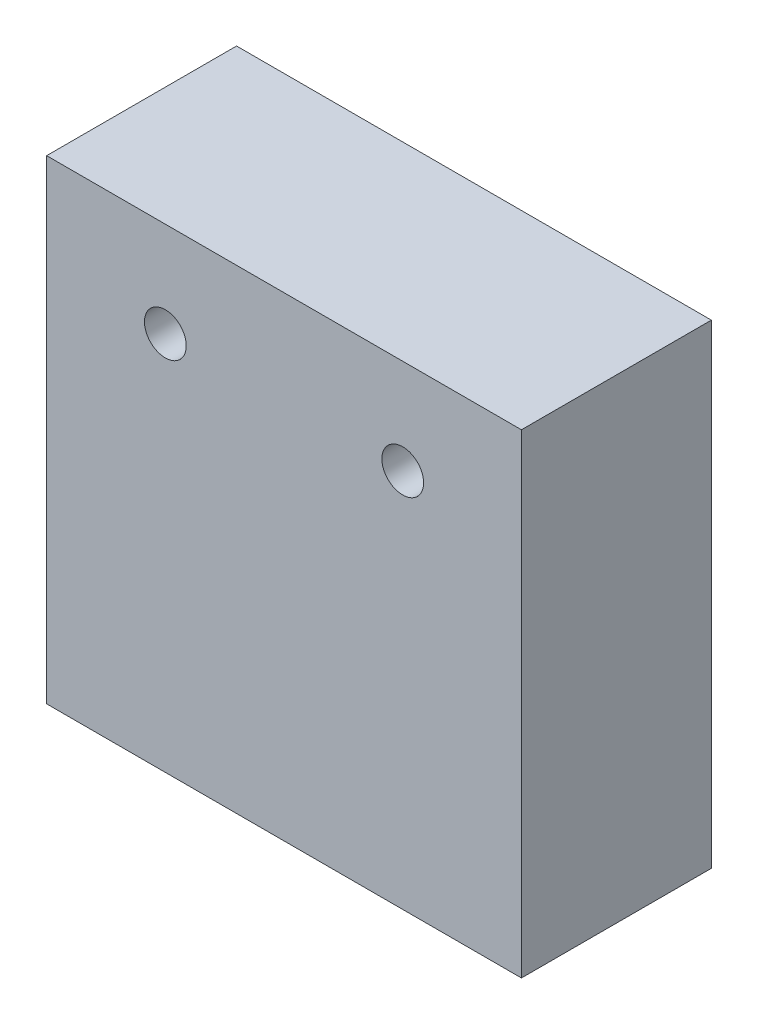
ISO-10303-21;
HEADER;
FILE_DESCRIPTION(('STEP AP214'),'2;1');
FILE_NAME('part.step','',(''),(''),'','','');
FILE_SCHEMA(('AUTOMOTIVE_DESIGN { 1 0 10303 214 1 1 1 1 }'));
ENDSEC;
DATA;
#1=APPLICATION_CONTEXT('core data for automotive mechanical design processes');
#2=APPLICATION_PROTOCOL_DEFINITION('international standard','automotive_design',2000,#1);
#3=PRODUCT_CONTEXT('',#1,'mechanical');
#4=PRODUCT('Part','Part','',(#3));
#5=PRODUCT_RELATED_PRODUCT_CATEGORY('part','',(#4));
#6=PRODUCT_DEFINITION_FORMATION('','',#4);
#7=PRODUCT_DEFINITION_CONTEXT('part definition',#1,'design');
#8=PRODUCT_DEFINITION('design','',#6,#7);
#9=PRODUCT_DEFINITION_SHAPE('','',#8);
#10=(LENGTH_UNIT() NAMED_UNIT(*) SI_UNIT(.MILLI.,.METRE.));
#11=(NAMED_UNIT(*) PLANE_ANGLE_UNIT() SI_UNIT($,.RADIAN.));
#12=(NAMED_UNIT(*) SI_UNIT($,.STERADIAN.) SOLID_ANGLE_UNIT());
#13=UNCERTAINTY_MEASURE_WITH_UNIT(LENGTH_MEASURE(1.E-05),#10,'distance_accuracy_value','');
#14=(GEOMETRIC_REPRESENTATION_CONTEXT(3) GLOBAL_UNCERTAINTY_ASSIGNED_CONTEXT((#13)) GLOBAL_UNIT_ASSIGNED_CONTEXT((#10,
#11,#12)) REPRESENTATION_CONTEXT('',''));
#15=CARTESIAN_POINT('',(0.,0.,0.));
#16=DIRECTION('',(0.,0.,1.));
#17=DIRECTION('',(1.,0.,0.));
#18=AXIS2_PLACEMENT_3D('',#15,#16,#17);
#19=CARTESIAN_POINT('',(0.,0.,6.35));
#20=DIRECTION('',(0.,1.,0.));
#21=DIRECTION('',(0.,0.,1.));
#22=AXIS2_PLACEMENT_3D('',#19,#20,#21);
#23=PLANE('',#22);
#24=CARTESIAN_POINT('',(-9.525,0.,0.));
#25=DIRECTION('',(0.,-1.,0.));
#26=DIRECTION('',(0.,0.,-1.));
#27=AXIS2_PLACEMENT_3D('',#24,#25,#26);
#28=CIRCLE('',#27,3.175);
#29=CARTESIAN_POINT('',(-9.525,0.,-3.175));
#30=VERTEX_POINT('',#29);
#31=EDGE_CURVE('E98',#30,#30,#28,.T.);
#32=ORIENTED_EDGE('',*,*,#31,.F.);
#33=EDGE_LOOP('',(#32));
#34=FACE_BOUND('',#33,.T.);
#35=DIRECTION('',(1.,0.,0.));
#36=VECTOR('',#35,1.);
#37=CARTESIAN_POINT('',(0.,0.,-6.35));
#38=LINE('',#37,#36);
#39=CARTESIAN_POINT('',(-15.875,0.,-6.35));
#40=VERTEX_POINT('',#39);
#41=CARTESIAN_POINT('',(15.875,0.,-6.35));
#42=VERTEX_POINT('',#41);
#43=EDGE_CURVE('E67',#40,#42,#38,.T.);
#44=ORIENTED_EDGE('',*,*,#43,.T.);
#45=DIRECTION('',(0.,0.,-1.));
#46=VECTOR('',#45,1.);
#47=CARTESIAN_POINT('',(15.875,0.,6.35));
#48=LINE('',#47,#46);
#49=CARTESIAN_POINT('',(15.875,0.,6.35));
#50=VERTEX_POINT('',#49);
#51=EDGE_CURVE('E136',#50,#42,#48,.T.);
#52=ORIENTED_EDGE('',*,*,#51,.F.);
#53=DIRECTION('',(1.,0.,0.));
#54=VECTOR('',#53,1.);
#55=CARTESIAN_POINT('',(-15.875,0.,6.35));
#56=LINE('',#55,#54);
#57=CARTESIAN_POINT('',(-15.875,0.,6.35));
#58=VERTEX_POINT('',#57);
#59=EDGE_CURVE('E124',#58,#50,#56,.T.);
#60=ORIENTED_EDGE('',*,*,#59,.F.);
#61=DIRECTION('',(0.,0.,-1.));
#62=VECTOR('',#61,1.);
#63=CARTESIAN_POINT('',(-15.875,0.,6.35));
#64=LINE('',#63,#62);
#65=EDGE_CURVE('E42',#58,#40,#64,.T.);
#66=ORIENTED_EDGE('',*,*,#65,.T.);
#67=EDGE_LOOP('',(#44,#52,#60,#66));
#68=FACE_BOUND('',#67,.T.);
#69=CARTESIAN_POINT('',(9.525,0.,0.));
#70=DIRECTION('',(0.,-1.,0.));
#71=DIRECTION('',(0.,0.,-1.));
#72=AXIS2_PLACEMENT_3D('',#69,#70,#71);
#73=CIRCLE('',#72,3.175);
#74=CARTESIAN_POINT('',(9.525,0.,-3.175));
#75=VERTEX_POINT('',#74);
#76=EDGE_CURVE('E97',#75,#75,#73,.T.);
#77=ORIENTED_EDGE('',*,*,#76,.F.);
#78=EDGE_LOOP('',(#77));
#79=FACE_BOUND('',#78,.T.);
#80=ADVANCED_FACE('F33',(#34,#68,#79),#23,.F.);
#81=CARTESIAN_POINT('',(0.,0.,6.35));
#82=DIRECTION('',(0.,0.,1.));
#83=DIRECTION('',(1.,0.,0.));
#84=AXIS2_PLACEMENT_3D('',#81,#82,#83);
#85=PLANE('',#84);
#86=CARTESIAN_POINT('',(-7.9375,25.4,6.35));
#87=DIRECTION('',(0.,0.,1.));
#88=DIRECTION('',(1.,0.,0.));
#89=AXIS2_PLACEMENT_3D('',#86,#87,#88);
#90=CIRCLE('',#89,1.397);
#91=CARTESIAN_POINT('',(-6.5405,25.4,6.35));
#92=VERTEX_POINT('',#91);
#93=EDGE_CURVE('E115',#92,#92,#90,.T.);
#94=ORIENTED_EDGE('',*,*,#93,.F.);
#95=EDGE_LOOP('',(#94));
#96=FACE_BOUND('',#95,.T.);
#97=DIRECTION('',(-1.,0.,0.));
#98=VECTOR('',#97,1.);
#99=CARTESIAN_POINT('',(15.875,31.75,6.35));
#100=LINE('',#99,#98);
#101=CARTESIAN_POINT('',(15.875,31.75,6.35));
#102=VERTEX_POINT('',#101);
#103=CARTESIAN_POINT('',(-15.875,31.75,6.35));
#104=VERTEX_POINT('',#103);
#105=EDGE_CURVE('E121',#102,#104,#100,.T.);
#106=ORIENTED_EDGE('',*,*,#105,.T.);
#107=DIRECTION('',(0.,-1.,0.));
#108=VECTOR('',#107,1.);
#109=CARTESIAN_POINT('',(-15.875,31.75,6.35));
#110=LINE('',#109,#108);
#111=EDGE_CURVE('E80',#104,#58,#110,.T.);
#112=ORIENTED_EDGE('',*,*,#111,.T.);
#113=ORIENTED_EDGE('',*,*,#59,.T.);
#114=DIRECTION('',(0.,1.,0.));
#115=VECTOR('',#114,1.);
#116=CARTESIAN_POINT('',(15.875,0.,6.35));
#117=LINE('',#116,#115);
#118=EDGE_CURVE('E50',#50,#102,#117,.T.);
#119=ORIENTED_EDGE('',*,*,#118,.T.);
#120=EDGE_LOOP('',(#106,#112,#113,#119));
#121=FACE_BOUND('',#120,.T.);
#122=CARTESIAN_POINT('',(7.9375,25.4,6.35));
#123=DIRECTION('',(0.,0.,1.));
#124=DIRECTION('',(1.,0.,0.));
#125=AXIS2_PLACEMENT_3D('',#122,#123,#124);
#126=CIRCLE('',#125,1.397);
#127=CARTESIAN_POINT('',(9.3345,25.4,6.35));
#128=VERTEX_POINT('',#127);
#129=EDGE_CURVE('E109',#128,#128,#126,.T.);
#130=ORIENTED_EDGE('',*,*,#129,.F.);
#131=EDGE_LOOP('',(#130));
#132=FACE_BOUND('',#131,.T.);
#133=ADVANCED_FACE('F161',(#96,#121,#132),#85,.T.);
#134=CARTESIAN_POINT('',(0.,0.,-6.35));
#135=DIRECTION('',(0.,0.,1.));
#136=DIRECTION('',(1.,0.,0.));
#137=AXIS2_PLACEMENT_3D('',#134,#135,#136);
#138=PLANE('',#137);
#139=CARTESIAN_POINT('',(-7.9375,25.4,-6.35));
#140=DIRECTION('',(0.,0.,1.));
#141=DIRECTION('',(1.,0.,0.));
#142=AXIS2_PLACEMENT_3D('',#139,#140,#141);
#143=CIRCLE('',#142,1.397);
#144=CARTESIAN_POINT('',(-6.5405,25.4,-6.35));
#145=VERTEX_POINT('',#144);
#146=EDGE_CURVE('E112',#145,#145,#143,.T.);
#147=ORIENTED_EDGE('',*,*,#146,.T.);
#148=EDGE_LOOP('',(#147));
#149=FACE_BOUND('',#148,.T.);
#150=DIRECTION('',(-1.,0.,0.));
#151=VECTOR('',#150,1.);
#152=CARTESIAN_POINT('',(15.875,31.75,-6.35));
#153=LINE('',#152,#151);
#154=CARTESIAN_POINT('',(15.875,31.75,-6.35));
#155=VERTEX_POINT('',#154);
#156=CARTESIAN_POINT('',(-15.875,31.75,-6.35));
#157=VERTEX_POINT('',#156);
#158=EDGE_CURVE('E118',#155,#157,#153,.T.);
#159=ORIENTED_EDGE('',*,*,#158,.F.);
#160=DIRECTION('',(0.,1.,0.));
#161=VECTOR('',#160,1.);
#162=CARTESIAN_POINT('',(15.875,0.,-6.35));
#163=LINE('',#162,#161);
#164=EDGE_CURVE('E73',#42,#155,#163,.T.);
#165=ORIENTED_EDGE('',*,*,#164,.F.);
#166=ORIENTED_EDGE('',*,*,#43,.F.);
#167=DIRECTION('',(0.,-1.,0.));
#168=VECTOR('',#167,1.);
#169=CARTESIAN_POINT('',(-15.875,31.75,-6.35));
#170=LINE('',#169,#168);
#171=EDGE_CURVE('E130',#157,#40,#170,.T.);
#172=ORIENTED_EDGE('',*,*,#171,.F.);
#173=EDGE_LOOP('',(#159,#165,#166,#172));
#174=FACE_BOUND('',#173,.T.);
#175=CARTESIAN_POINT('',(7.9375,25.4,-6.35));
#176=DIRECTION('',(0.,0.,1.));
#177=DIRECTION('',(1.,0.,0.));
#178=AXIS2_PLACEMENT_3D('',#175,#176,#177);
#179=CIRCLE('',#178,1.397);
#180=CARTESIAN_POINT('',(9.3345,25.4,-6.35));
#181=VERTEX_POINT('',#180);
#182=EDGE_CURVE('E108',#181,#181,#179,.T.);
#183=ORIENTED_EDGE('',*,*,#182,.T.);
#184=EDGE_LOOP('',(#183));
#185=FACE_BOUND('',#184,.T.);
#186=ADVANCED_FACE('F143',(#149,#174,#185),#138,.F.);
#187=CARTESIAN_POINT('',(15.875,31.75,6.35));
#188=DIRECTION('',(0.,-1.,0.));
#189=DIRECTION('',(1.,0.,0.));
#190=AXIS2_PLACEMENT_3D('',#187,#188,#189);
#191=PLANE('',#190);
#192=ORIENTED_EDGE('',*,*,#158,.T.);
#193=DIRECTION('',(0.,0.,-1.));
#194=VECTOR('',#193,1.);
#195=CARTESIAN_POINT('',(-15.875,31.75,6.35));
#196=LINE('',#195,#194);
#197=EDGE_CURVE('E11',#104,#157,#196,.T.);
#198=ORIENTED_EDGE('',*,*,#197,.F.);
#199=ORIENTED_EDGE('',*,*,#105,.F.);
#200=DIRECTION('',(0.,0.,-1.));
#201=VECTOR('',#200,1.);
#202=CARTESIAN_POINT('',(15.875,31.75,6.35));
#203=LINE('',#202,#201);
#204=EDGE_CURVE('E127',#102,#155,#203,.T.);
#205=ORIENTED_EDGE('',*,*,#204,.T.);
#206=EDGE_LOOP('',(#192,#198,#199,#205));
#207=FACE_BOUND('',#206,.T.);
#208=ADVANCED_FACE('F35',(#207),#191,.F.);
#209=CARTESIAN_POINT('',(-15.875,31.75,6.35));
#210=DIRECTION('',(1.,0.,0.));
#211=DIRECTION('',(0.,1.,0.));
#212=AXIS2_PLACEMENT_3D('',#209,#210,#211);
#213=PLANE('',#212);
#214=ORIENTED_EDGE('',*,*,#171,.T.);
#215=ORIENTED_EDGE('',*,*,#65,.F.);
#216=ORIENTED_EDGE('',*,*,#111,.F.);
#217=ORIENTED_EDGE('',*,*,#197,.T.);
#218=EDGE_LOOP('',(#214,#215,#216,#217));
#219=FACE_BOUND('',#218,.T.);
#220=ADVANCED_FACE('F139',(#219),#213,.F.);
#221=CARTESIAN_POINT('',(15.875,0.,6.35));
#222=DIRECTION('',(-1.,0.,0.));
#223=DIRECTION('',(0.,-1.,0.));
#224=AXIS2_PLACEMENT_3D('',#221,#222,#223);
#225=PLANE('',#224);
#226=ORIENTED_EDGE('',*,*,#164,.T.);
#227=ORIENTED_EDGE('',*,*,#204,.F.);
#228=ORIENTED_EDGE('',*,*,#118,.F.);
#229=ORIENTED_EDGE('',*,*,#51,.T.);
#230=EDGE_LOOP('',(#226,#227,#228,#229));
#231=FACE_BOUND('',#230,.T.);
#232=ADVANCED_FACE('F147',(#231),#225,.F.);
#233=CARTESIAN_POINT('',(-7.9375,25.4,6.35));
#234=DIRECTION('',(0.,0.,-1.));
#235=DIRECTION('',(-1.,0.,0.));
#236=AXIS2_PLACEMENT_3D('',#233,#234,#235);
#237=CYLINDRICAL_SURFACE('',#236,1.397);
#238=ORIENTED_EDGE('',*,*,#93,.T.);
#239=EDGE_LOOP('',(#238));
#240=FACE_BOUND('',#239,.T.);
#241=ORIENTED_EDGE('',*,*,#146,.F.);
#242=EDGE_LOOP('',(#241));
#243=FACE_BOUND('',#242,.T.);
#244=ADVANCED_FACE('F149',(#240,#243),#237,.F.);
#245=CARTESIAN_POINT('',(7.9375,25.4,6.35));
#246=DIRECTION('',(0.,0.,-1.));
#247=DIRECTION('',(-1.,0.,0.));
#248=AXIS2_PLACEMENT_3D('',#245,#246,#247);
#249=CYLINDRICAL_SURFACE('',#248,1.397);
#250=ORIENTED_EDGE('',*,*,#129,.T.);
#251=EDGE_LOOP('',(#250));
#252=FACE_BOUND('',#251,.T.);
#253=ORIENTED_EDGE('',*,*,#182,.F.);
#254=EDGE_LOOP('',(#253));
#255=FACE_BOUND('',#254,.T.);
#256=ADVANCED_FACE('F155',(#252,#255),#249,.F.);
#257=CARTESIAN_POINT('',(9.525,20.32,0.));
#258=DIRECTION('',(0.,-1.,0.));
#259=DIRECTION('',(0.,0.,-1.));
#260=AXIS2_PLACEMENT_3D('',#257,#258,#259);
#261=CONICAL_SURFACE('',#260,3.175,1.02974425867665);
#262=CARTESIAN_POINT('',(9.525,22.2277324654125,0.));
#263=VERTEX_POINT('',#262);
#264=VERTEX_LOOP('',#263);
#265=FACE_BOUND('',#264,.T.);
#266=CARTESIAN_POINT('',(9.525,20.32,0.));
#267=DIRECTION('',(0.,-1.,0.));
#268=DIRECTION('',(0.,0.,-1.));
#269=AXIS2_PLACEMENT_3D('',#266,#267,#268);
#270=CIRCLE('',#269,3.175);
#271=CARTESIAN_POINT('',(9.525,20.32,-3.175));
#272=VERTEX_POINT('',#271);
#273=EDGE_CURVE('E101',#272,#272,#270,.T.);
#274=ORIENTED_EDGE('',*,*,#273,.T.);
#275=EDGE_LOOP('',(#274));
#276=FACE_BOUND('',#275,.T.);
#277=ADVANCED_FACE('F177',(#265,#276),#261,.F.);
#278=CARTESIAN_POINT('',(9.525,0.,0.));
#279=DIRECTION('',(0.,-1.,0.));
#280=DIRECTION('',(0.,0.,-1.));
#281=AXIS2_PLACEMENT_3D('',#278,#279,#280);
#282=CYLINDRICAL_SURFACE('',#281,3.175);
#283=ORIENTED_EDGE('',*,*,#273,.F.);
#284=EDGE_LOOP('',(#283));
#285=FACE_BOUND('',#284,.T.);
#286=ORIENTED_EDGE('',*,*,#76,.T.);
#287=EDGE_LOOP('',(#286));
#288=FACE_BOUND('',#287,.T.);
#289=ADVANCED_FACE('F91',(#285,#288),#282,.F.);
#290=CARTESIAN_POINT('',(-9.525,20.32,0.));
#291=DIRECTION('',(0.,-1.,0.));
#292=DIRECTION('',(0.,0.,-1.));
#293=AXIS2_PLACEMENT_3D('',#290,#291,#292);
#294=CONICAL_SURFACE('',#293,3.175,1.02974425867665);
#295=CARTESIAN_POINT('',(-9.52500000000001,22.2277324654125,0.));
#296=VERTEX_POINT('',#295);
#297=VERTEX_LOOP('',#296);
#298=FACE_BOUND('',#297,.T.);
#299=CARTESIAN_POINT('',(-9.525,20.32,0.));
#300=DIRECTION('',(0.,-1.,0.));
#301=DIRECTION('',(0.,0.,-1.));
#302=AXIS2_PLACEMENT_3D('',#299,#300,#301);
#303=CIRCLE('',#302,3.175);
#304=CARTESIAN_POINT('',(-9.525,20.32,-3.175));
#305=VERTEX_POINT('',#304);
#306=EDGE_CURVE('E95',#305,#305,#303,.T.);
#307=ORIENTED_EDGE('',*,*,#306,.T.);
#308=EDGE_LOOP('',(#307));
#309=FACE_BOUND('',#308,.T.);
#310=ADVANCED_FACE('F87',(#298,#309),#294,.F.);
#311=CARTESIAN_POINT('',(-9.525,0.,0.));
#312=DIRECTION('',(0.,-1.,0.));
#313=DIRECTION('',(0.,0.,-1.));
#314=AXIS2_PLACEMENT_3D('',#311,#312,#313);
#315=CYLINDRICAL_SURFACE('',#314,3.175);
#316=ORIENTED_EDGE('',*,*,#306,.F.);
#317=EDGE_LOOP('',(#316));
#318=FACE_BOUND('',#317,.T.);
#319=ORIENTED_EDGE('',*,*,#31,.T.);
#320=EDGE_LOOP('',(#319));
#321=FACE_BOUND('',#320,.T.);
#322=ADVANCED_FACE('F90',(#318,#321),#315,.F.);
#323=CLOSED_SHELL('',(#80,#133,#186,#208,#220,#232,#244,#256,#277,#289,#310,#322));
#324=MANIFOLD_SOLID_BREP('B2',#323);
#325=ADVANCED_BREP_SHAPE_REPRESENTATION('',(#18,#324),#14);
#326=SHAPE_DEFINITION_REPRESENTATION(#9,#325);
ENDSEC;
END-ISO-10303-21;
